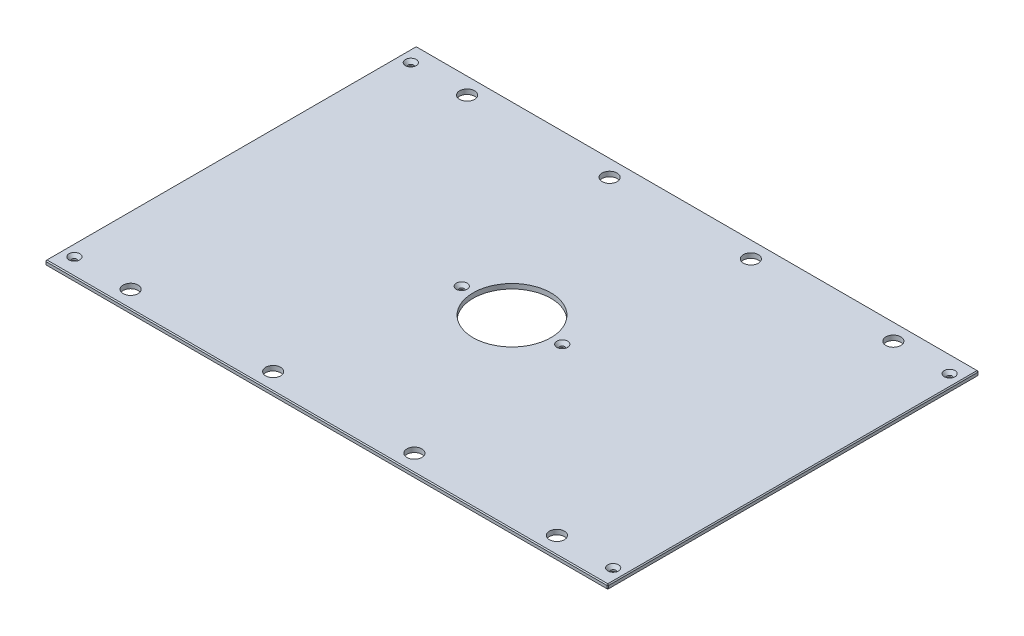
from build123d import *

# Parameters (mm, degrees)
SKETCH1_W                                     = 746.125
SKETCH1_H                                     = 492.125
BOSS_EXTRUDE1_DEPTH                           = 6.35
SKETCH13_R                                    = 51.562
CUT_EXTRUDE6_DEPTH                            = 447.948213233
F_25_32_0_78125_DIAMETER_HOLE1_D              = 19.84375
CHAMFER2_SIZE                                 = 1.27
CSK_FOR_1_4_FLAT_HEAD_MACHINE_SCREW1_AT_COUNT = 2
CSK_FOR_1_4_FLAT_HEAD_MACHINE_SCREW1_AT_PITCH = 446.08496
CSK_FOR_1_4_FLAT_HEAD_MACHINE_SCREW1_2_COUNT  = 2
CSK_FOR_1_4_FLAT_HEAD_MACHINE_SCREW1_2_PITCH  = 842.213412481
CSK_FOR_1_4_FLAT_HEAD_MACHINE_SCREW1_3_COUNT  = 2
CSK_FOR_1_4_FLAT_HEAD_MACHINE_SCREW1_3_PITCH  = 478.964890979
CSK_FOR_1_4_FLAT_HEAD_MACHINE_SCREW1_4_COUNT  = 2
CSK_FOR_1_4_FLAT_HEAD_MACHINE_SCREW1_4_PITCH  = 366.258734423
CSK_FOR_1_4_FLAT_HEAD_MACHINE_SCREW1_5_COUNT  = 2
CSK_FOR_1_4_FLAT_HEAD_MACHINE_SCREW1_5_PITCH  = 714.375
CSK_FOR_1_4_FLAT_HEAD_MACHINE_SCREW1_6_COUNT  = 2
CSK_FOR_1_4_FLAT_HEAD_MACHINE_SCREW1_6_PITCH  = 639.7625
CSK_FOR_1_4_FLAT_HEAD_MACHINE_SCREW1_7_COUNT  = 2
CSK_FOR_1_4_FLAT_HEAD_MACHINE_SCREW1_7_PITCH  = 779.928104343


with BuildPart() as part:
    # Sketch1 → Boss-Extrude1 (new body)
    with BuildSketch(Plane(origin=(0, 0, 0), x_dir=(1, 0, 0), z_dir=(0, 1, 0))):
        Rectangle(SKETCH1_W, SKETCH1_H)
    extrude(amount=BOSS_EXTRUDE1_DEPTH)

    # Sketch13 → Cut-Extrude6 (cut, through all)
    with BuildSketch(Plane(origin=(0, 6.35, 0), x_dir=(1, 0, 0), z_dir=(0, 1, 0))):
        with Locations(Location((0, 0, 0), (0, 0, 270))):
            Circle(SKETCH13_R)
    extrude(amount=-CUT_EXTRUDE6_DEPTH, mode=Mode.SUBTRACT)

    # 25_32 _0.78125_ Diameter Hole1 (through all)
    with Locations(Plane(origin=(0, 6.35, 0), x_dir=(1, 0, 0), z_dir=(0, 1, 0))):
        with Locations((282.575, 223.04248), (-282.575, 223.04248), (282.575, -223.04248), (-282.575, -223.04248), (-93.6625, 223.04248), (93.6625, 223.04248), (93.6625, -223.04248), (-93.6625, -223.04248)):
            Hole(F_25_32_0_78125_DIAMETER_HOLE1_D / 2)

    # Chamfer2
    chamfer2_edges = [part.edges().sort_by_distance(p)[0] for p in [
        (373.0625, 6.35, 0),
        (0, 6.35, -246.0625),
        (-373.0625, 6.35, 0),
        (0, 0, -246.0625),
        (373.0625, 0, 0),
        (0, 0, 246.0625),
        (-373.0625, 0, 0),
        (0, 6.35, 246.0625),
        (-373.0625, 3.175, -246.0625),
        (373.0625, 3.175, -246.0625),
        (373.0625, 3.175, 246.0625),
        (-373.0625, 3.175, 246.0625),
    ]]
    chamfer(chamfer2_edges, length=CHAMFER2_SIZE)

    # Sketch24 → CSK for 1_4 Flat Head Machine Screw1 (revolve, cut)
    with BuildSketch(Plane(origin=(357.1875, 6.35, -223.04248), x_dir=(0, 0, 1), z_dir=(1, 0, 0))):
        Polygon((0, 0), (0, 6.35), (3.3782, 6.35), (3.3782, 4.324464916), (7.1374, 0), align=None)
    csk_for_1_4_flat_head_machine_screw1 = revolve(axis=Axis((357.1875, 12.7, -223.04248), (0, -1, 0)), mode=Mode.SUBTRACT)

    # CSK for 1_4 Flat Head Machine Screw1 at: CSK for 1_4 Flat Head Machine Screw1 ×2
    with Locations(*[(0, 0, i * CSK_FOR_1_4_FLAT_HEAD_MACHINE_SCREW1_AT_PITCH) for i in range(1, CSK_FOR_1_4_FLAT_HEAD_MACHINE_SCREW1_AT_COUNT)]):
        add(csk_for_1_4_flat_head_machine_screw1, mode=Mode.SUBTRACT)

    # CSK for 1_4 Flat Head Machine Screw1 2: CSK for 1_4 Flat Head Machine Screw1 ×2
    with Locations(*[Vector(-0.8482113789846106, 0, 0.5296578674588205) * (i * CSK_FOR_1_4_FLAT_HEAD_MACHINE_SCREW1_2_PITCH) for i in range(1, CSK_FOR_1_4_FLAT_HEAD_MACHINE_SCREW1_2_COUNT)]):
        add(csk_for_1_4_flat_head_machine_screw1, mode=Mode.SUBTRACT)

    # CSK for 1_4 Flat Head Machine Screw1 3: CSK for 1_4 Flat Head Machine Screw1 ×2
    with Locations(*[Vector(-0.8849552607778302, 0, 0.4656760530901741) * (i * CSK_FOR_1_4_FLAT_HEAD_MACHINE_SCREW1_3_PITCH) for i in range(1, CSK_FOR_1_4_FLAT_HEAD_MACHINE_SCREW1_3_COUNT)]):
        add(csk_for_1_4_flat_head_machine_screw1, mode=Mode.SUBTRACT)

    # CSK for 1_4 Flat Head Machine Screw1 4: CSK for 1_4 Flat Head Machine Screw1 ×2
    with Locations(*[Vector(-0.7931892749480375, 0, 0.6089751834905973) * (i * CSK_FOR_1_4_FLAT_HEAD_MACHINE_SCREW1_4_PITCH) for i in range(1, CSK_FOR_1_4_FLAT_HEAD_MACHINE_SCREW1_4_COUNT)]):
        add(csk_for_1_4_flat_head_machine_screw1, mode=Mode.SUBTRACT)

    # CSK for 1_4 Flat Head Machine Screw1 5: CSK for 1_4 Flat Head Machine Screw1 ×2
    with Locations(*[(-i * CSK_FOR_1_4_FLAT_HEAD_MACHINE_SCREW1_5_PITCH, 0, 0) for i in range(1, CSK_FOR_1_4_FLAT_HEAD_MACHINE_SCREW1_5_COUNT)]):
        add(csk_for_1_4_flat_head_machine_screw1, mode=Mode.SUBTRACT)

    # CSK for 1_4 Flat Head Machine Screw1 6: CSK for 1_4 Flat Head Machine Screw1 ×2
    with Locations(*[(-i * CSK_FOR_1_4_FLAT_HEAD_MACHINE_SCREW1_6_PITCH, 0, 0) for i in range(1, CSK_FOR_1_4_FLAT_HEAD_MACHINE_SCREW1_6_COUNT)]):
        add(csk_for_1_4_flat_head_machine_screw1, mode=Mode.SUBTRACT)

    # CSK for 1_4 Flat Head Machine Screw1 7: CSK for 1_4 Flat Head Machine Screw1 ×2
    with Locations(*[Vector(-0.8202839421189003, 0, 0.5719565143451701) * (i * CSK_FOR_1_4_FLAT_HEAD_MACHINE_SCREW1_7_PITCH) for i in range(1, CSK_FOR_1_4_FLAT_HEAD_MACHINE_SCREW1_7_COUNT)]):
        add(csk_for_1_4_flat_head_machine_screw1, mode=Mode.SUBTRACT)


solid = part.part
